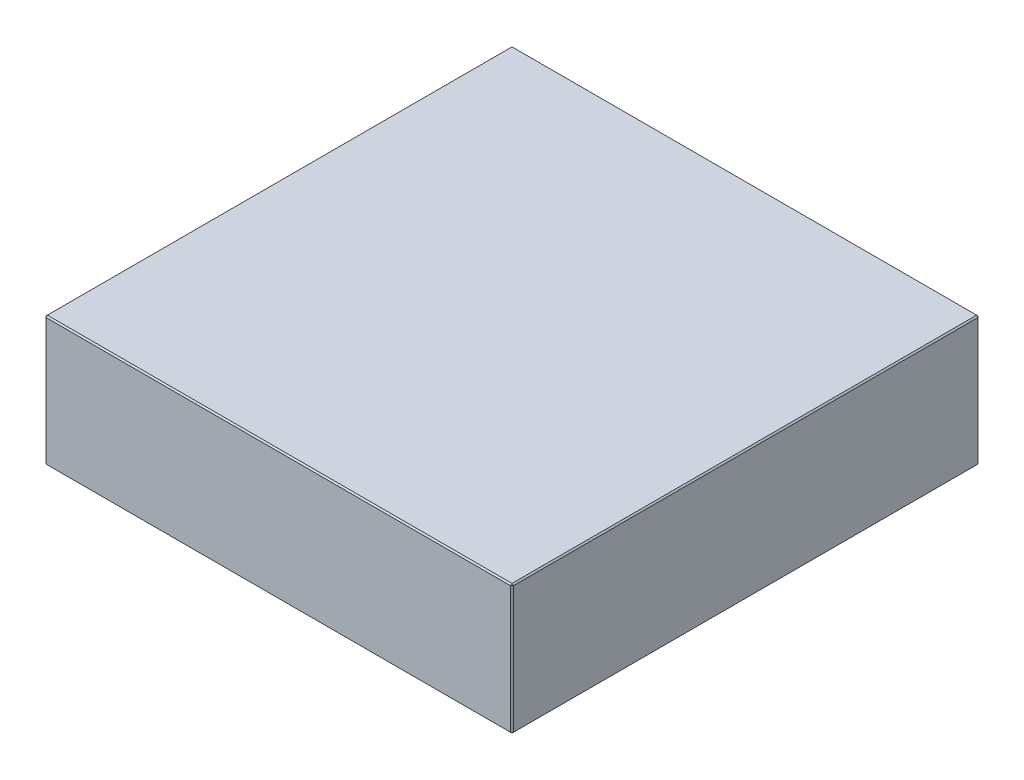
ISO-10303-21;
HEADER;
FILE_DESCRIPTION(('STEP AP214'),'2;1');
FILE_NAME('part.step','',(''),(''),'','','');
FILE_SCHEMA(('AUTOMOTIVE_DESIGN { 1 0 10303 214 1 1 1 1 }'));
ENDSEC;
DATA;
#1=APPLICATION_CONTEXT('core data for automotive mechanical design processes');
#2=APPLICATION_PROTOCOL_DEFINITION('international standard','automotive_design',2000,#1);
#3=PRODUCT_CONTEXT('',#1,'mechanical');
#4=PRODUCT('Part','Part','',(#3));
#5=PRODUCT_RELATED_PRODUCT_CATEGORY('part','',(#4));
#6=PRODUCT_DEFINITION_FORMATION('','',#4);
#7=PRODUCT_DEFINITION_CONTEXT('part definition',#1,'design');
#8=PRODUCT_DEFINITION('design','',#6,#7);
#9=PRODUCT_DEFINITION_SHAPE('','',#8);
#10=(LENGTH_UNIT() NAMED_UNIT(*) SI_UNIT(.MILLI.,.METRE.));
#11=(NAMED_UNIT(*) PLANE_ANGLE_UNIT() SI_UNIT($,.RADIAN.));
#12=(NAMED_UNIT(*) SI_UNIT($,.STERADIAN.) SOLID_ANGLE_UNIT());
#13=UNCERTAINTY_MEASURE_WITH_UNIT(LENGTH_MEASURE(1.E-05),#10,'distance_accuracy_value','');
#14=(GEOMETRIC_REPRESENTATION_CONTEXT(3) GLOBAL_UNCERTAINTY_ASSIGNED_CONTEXT((#13)) GLOBAL_UNIT_ASSIGNED_CONTEXT((#10,
#11,#12)) REPRESENTATION_CONTEXT('',''));
#15=CARTESIAN_POINT('',(0.,0.,0.));
#16=DIRECTION('',(0.,0.,1.));
#17=DIRECTION('',(1.,0.,0.));
#18=AXIS2_PLACEMENT_3D('',#15,#16,#17);
#19=CARTESIAN_POINT('',(-173.,96.,173.));
#20=DIRECTION('',(1.,0.,0.));
#21=DIRECTION('',(0.,0.,-1.));
#22=AXIS2_PLACEMENT_3D('',#19,#20,#21);
#23=PLANE('',#22);
#24=DIRECTION('',(0.,-1.,0.));
#25=VECTOR('',#24,1.);
#26=CARTESIAN_POINT('',(-173.,96.,-172.));
#27=LINE('',#26,#25);
#28=CARTESIAN_POINT('',(-173.,95.,-172.));
#29=VERTEX_POINT('',#28);
#30=CARTESIAN_POINT('',(-173.,0.999999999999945,-172.));
#31=VERTEX_POINT('',#30);
#32=EDGE_CURVE('E114',#29,#31,#27,.T.);
#33=ORIENTED_EDGE('',*,*,#32,.T.);
#34=DIRECTION('',(0.,0.,1.));
#35=VECTOR('',#34,1.);
#36=CARTESIAN_POINT('',(-173.,0.999999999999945,173.));
#37=LINE('',#36,#35);
#38=CARTESIAN_POINT('',(-173.,0.999999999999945,172.));
#39=VERTEX_POINT('',#38);
#40=EDGE_CURVE('E110',#31,#39,#37,.T.);
#41=ORIENTED_EDGE('',*,*,#40,.T.);
#42=DIRECTION('',(0.,1.,0.));
#43=VECTOR('',#42,1.);
#44=CARTESIAN_POINT('',(-173.,96.,172.));
#45=LINE('',#44,#43);
#46=CARTESIAN_POINT('',(-173.,95.,172.));
#47=VERTEX_POINT('',#46);
#48=EDGE_CURVE('E103',#39,#47,#45,.T.);
#49=ORIENTED_EDGE('',*,*,#48,.T.);
#50=DIRECTION('',(0.,0.,-1.));
#51=VECTOR('',#50,1.);
#52=CARTESIAN_POINT('',(-173.,95.,-173.));
#53=LINE('',#52,#51);
#54=EDGE_CURVE('E107',#47,#29,#53,.T.);
#55=ORIENTED_EDGE('',*,*,#54,.T.);
#56=EDGE_LOOP('',(#33,#41,#49,#55));
#57=FACE_BOUND('',#56,.T.);
#58=ADVANCED_FACE('F15',(#57),#23,.F.);
#59=CARTESIAN_POINT('',(173.,96.,173.));
#60=DIRECTION('',(0.,0.,-1.));
#61=DIRECTION('',(-1.,0.,0.));
#62=AXIS2_PLACEMENT_3D('',#59,#60,#61);
#63=PLANE('',#62);
#64=DIRECTION('',(-1.,0.,0.));
#65=VECTOR('',#64,1.);
#66=CARTESIAN_POINT('',(-173.,95.,173.));
#67=LINE('',#66,#65);
#68=CARTESIAN_POINT('',(172.,95.,173.));
#69=VERTEX_POINT('',#68);
#70=CARTESIAN_POINT('',(-172.,95.,173.));
#71=VERTEX_POINT('',#70);
#72=EDGE_CURVE('E164',#69,#71,#67,.T.);
#73=ORIENTED_EDGE('',*,*,#72,.T.);
#74=DIRECTION('',(0.,-1.,0.));
#75=VECTOR('',#74,1.);
#76=CARTESIAN_POINT('',(-172.,96.,173.));
#77=LINE('',#76,#75);
#78=CARTESIAN_POINT('',(-172.,0.999999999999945,173.));
#79=VERTEX_POINT('',#78);
#80=EDGE_CURVE('E122',#71,#79,#77,.T.);
#81=ORIENTED_EDGE('',*,*,#80,.T.);
#82=DIRECTION('',(1.,0.,0.));
#83=VECTOR('',#82,1.);
#84=CARTESIAN_POINT('',(173.,0.999999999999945,173.));
#85=LINE('',#84,#83);
#86=CARTESIAN_POINT('',(172.,0.999999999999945,173.));
#87=VERTEX_POINT('',#86);
#88=EDGE_CURVE('E168',#79,#87,#85,.T.);
#89=ORIENTED_EDGE('',*,*,#88,.T.);
#90=DIRECTION('',(0.,1.,0.));
#91=VECTOR('',#90,1.);
#92=CARTESIAN_POINT('',(172.,96.,173.));
#93=LINE('',#92,#91);
#94=EDGE_CURVE('E166',#87,#69,#93,.T.);
#95=ORIENTED_EDGE('',*,*,#94,.T.);
#96=EDGE_LOOP('',(#73,#81,#89,#95));
#97=FACE_BOUND('',#96,.T.);
#98=ADVANCED_FACE('F275',(#97),#63,.F.);
#99=CARTESIAN_POINT('',(173.,96.,173.));
#100=DIRECTION('',(-1.,0.,0.));
#101=DIRECTION('',(0.,0.,1.));
#102=AXIS2_PLACEMENT_3D('',#99,#100,#101);
#103=PLANE('',#102);
#104=DIRECTION('',(0.,0.,-1.));
#105=VECTOR('',#104,1.);
#106=CARTESIAN_POINT('',(173.,0.999999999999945,173.));
#107=LINE('',#106,#105);
#108=CARTESIAN_POINT('',(173.,0.999999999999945,172.));
#109=VERTEX_POINT('',#108);
#110=CARTESIAN_POINT('',(173.,0.999999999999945,-172.));
#111=VERTEX_POINT('',#110);
#112=EDGE_CURVE('E159',#109,#111,#107,.T.);
#113=ORIENTED_EDGE('',*,*,#112,.T.);
#114=DIRECTION('',(0.,1.,0.));
#115=VECTOR('',#114,1.);
#116=CARTESIAN_POINT('',(173.,96.,-172.));
#117=LINE('',#116,#115);
#118=CARTESIAN_POINT('',(173.,95.,-172.));
#119=VERTEX_POINT('',#118);
#120=EDGE_CURVE('E161',#111,#119,#117,.T.);
#121=ORIENTED_EDGE('',*,*,#120,.T.);
#122=DIRECTION('',(0.,0.,1.));
#123=VECTOR('',#122,1.);
#124=CARTESIAN_POINT('',(173.,95.,173.));
#125=LINE('',#124,#123);
#126=CARTESIAN_POINT('',(173.,95.,172.));
#127=VERTEX_POINT('',#126);
#128=EDGE_CURVE('E155',#119,#127,#125,.T.);
#129=ORIENTED_EDGE('',*,*,#128,.T.);
#130=DIRECTION('',(0.,-1.,0.));
#131=VECTOR('',#130,1.);
#132=CARTESIAN_POINT('',(173.,96.,172.));
#133=LINE('',#132,#131);
#134=EDGE_CURVE('E157',#127,#109,#133,.T.);
#135=ORIENTED_EDGE('',*,*,#134,.T.);
#136=EDGE_LOOP('',(#113,#121,#129,#135));
#137=FACE_BOUND('',#136,.T.);
#138=ADVANCED_FACE('F254',(#137),#103,.F.);
#139=CARTESIAN_POINT('',(173.,96.,-173.));
#140=DIRECTION('',(0.,0.,1.));
#141=DIRECTION('',(1.,0.,0.));
#142=AXIS2_PLACEMENT_3D('',#139,#140,#141);
#143=PLANE('',#142);
#144=DIRECTION('',(0.,-1.,0.));
#145=VECTOR('',#144,1.);
#146=CARTESIAN_POINT('',(172.,96.,-173.));
#147=LINE('',#146,#145);
#148=CARTESIAN_POINT('',(172.,95.,-173.));
#149=VERTEX_POINT('',#148);
#150=CARTESIAN_POINT('',(172.,0.999999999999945,-173.));
#151=VERTEX_POINT('',#150);
#152=EDGE_CURVE('E148',#149,#151,#147,.T.);
#153=ORIENTED_EDGE('',*,*,#152,.T.);
#154=DIRECTION('',(-1.,0.,0.));
#155=VECTOR('',#154,1.);
#156=CARTESIAN_POINT('',(173.,0.999999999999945,-173.));
#157=LINE('',#156,#155);
#158=CARTESIAN_POINT('',(-172.,0.999999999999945,-173.));
#159=VERTEX_POINT('',#158);
#160=EDGE_CURVE('E153',#151,#159,#157,.T.);
#161=ORIENTED_EDGE('',*,*,#160,.T.);
#162=DIRECTION('',(0.,1.,0.));
#163=VECTOR('',#162,1.);
#164=CARTESIAN_POINT('',(-172.,96.,-173.));
#165=LINE('',#164,#163);
#166=CARTESIAN_POINT('',(-172.,95.,-173.));
#167=VERTEX_POINT('',#166);
#168=EDGE_CURVE('E150',#159,#167,#165,.T.);
#169=ORIENTED_EDGE('',*,*,#168,.T.);
#170=DIRECTION('',(1.,0.,0.));
#171=VECTOR('',#170,1.);
#172=CARTESIAN_POINT('',(173.,95.,-173.));
#173=LINE('',#172,#171);
#174=EDGE_CURVE('E146',#167,#149,#173,.T.);
#175=ORIENTED_EDGE('',*,*,#174,.T.);
#176=EDGE_LOOP('',(#153,#161,#169,#175));
#177=FACE_BOUND('',#176,.T.);
#178=ADVANCED_FACE('F284',(#177),#143,.F.);
#179=CARTESIAN_POINT('',(0.,96.,0.));
#180=DIRECTION('',(0.,1.,0.));
#181=DIRECTION('',(0.,0.,1.));
#182=AXIS2_PLACEMENT_3D('',#179,#180,#181);
#183=PLANE('',#182);
#184=DIRECTION('',(0.,0.,-1.));
#185=VECTOR('',#184,1.);
#186=CARTESIAN_POINT('',(172.,96.,-173.));
#187=LINE('',#186,#185);
#188=CARTESIAN_POINT('',(172.,96.,172.));
#189=VERTEX_POINT('',#188);
#190=CARTESIAN_POINT('',(172.,96.,-172.));
#191=VERTEX_POINT('',#190);
#192=EDGE_CURVE('E24',#189,#191,#187,.T.);
#193=ORIENTED_EDGE('',*,*,#192,.T.);
#194=DIRECTION('',(-1.,0.,0.));
#195=VECTOR('',#194,1.);
#196=CARTESIAN_POINT('',(-173.,96.,-172.));
#197=LINE('',#196,#195);
#198=CARTESIAN_POINT('',(-172.,96.,-172.));
#199=VERTEX_POINT('',#198);
#200=EDGE_CURVE('E9',#191,#199,#197,.T.);
#201=ORIENTED_EDGE('',*,*,#200,.T.);
#202=DIRECTION('',(0.,0.,1.));
#203=VECTOR('',#202,1.);
#204=CARTESIAN_POINT('',(-172.,96.,173.));
#205=LINE('',#204,#203);
#206=CARTESIAN_POINT('',(-172.,96.,172.));
#207=VERTEX_POINT('',#206);
#208=EDGE_CURVE('E180',#199,#207,#205,.T.);
#209=ORIENTED_EDGE('',*,*,#208,.T.);
#210=DIRECTION('',(1.,0.,0.));
#211=VECTOR('',#210,1.);
#212=CARTESIAN_POINT('',(173.,96.,172.));
#213=LINE('',#212,#211);
#214=EDGE_CURVE('E35',#207,#189,#213,.T.);
#215=ORIENTED_EDGE('',*,*,#214,.T.);
#216=EDGE_LOOP('',(#193,#201,#209,#215));
#217=FACE_BOUND('',#216,.T.);
#218=ADVANCED_FACE('F350',(#217),#183,.T.);
#219=CARTESIAN_POINT('',(0.,0.,0.));
#220=DIRECTION('',(0.,1.,0.));
#221=DIRECTION('',(0.,0.,1.));
#222=AXIS2_PLACEMENT_3D('',#219,#220,#221);
#223=PLANE('',#222);
#224=DIRECTION('',(0.,0.,1.));
#225=VECTOR('',#224,1.);
#226=CARTESIAN_POINT('',(172.,0.,0.));
#227=LINE('',#226,#225);
#228=CARTESIAN_POINT('',(172.,0.,-172.));
#229=VERTEX_POINT('',#228);
#230=CARTESIAN_POINT('',(172.,0.,172.));
#231=VERTEX_POINT('',#230);
#232=EDGE_CURVE('E171',#229,#231,#227,.T.);
#233=ORIENTED_EDGE('',*,*,#232,.T.);
#234=DIRECTION('',(-1.,0.,0.));
#235=VECTOR('',#234,1.);
#236=CARTESIAN_POINT('',(0.,0.,172.));
#237=LINE('',#236,#235);
#238=CARTESIAN_POINT('',(-172.,0.,172.));
#239=VERTEX_POINT('',#238);
#240=EDGE_CURVE('E177',#231,#239,#237,.T.);
#241=ORIENTED_EDGE('',*,*,#240,.T.);
#242=DIRECTION('',(0.,0.,-1.));
#243=VECTOR('',#242,1.);
#244=CARTESIAN_POINT('',(-172.,0.,0.));
#245=LINE('',#244,#243);
#246=CARTESIAN_POINT('',(-172.,0.,-172.));
#247=VERTEX_POINT('',#246);
#248=EDGE_CURVE('E175',#239,#247,#245,.T.);
#249=ORIENTED_EDGE('',*,*,#248,.T.);
#250=DIRECTION('',(1.,0.,0.));
#251=VECTOR('',#250,1.);
#252=CARTESIAN_POINT('',(0.,0.,-172.));
#253=LINE('',#252,#251);
#254=EDGE_CURVE('E173',#247,#229,#253,.T.);
#255=ORIENTED_EDGE('',*,*,#254,.T.);
#256=EDGE_LOOP('',(#233,#241,#249,#255));
#257=FACE_BOUND('',#256,.T.);
#258=ADVANCED_FACE('F246',(#257),#223,.F.);
#259=CARTESIAN_POINT('',(173.,96.,172.));
#260=DIRECTION('',(-0.707106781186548,0.,-0.707106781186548));
#261=DIRECTION('',(0.,-1.,0.));
#262=AXIS2_PLACEMENT_3D('',#259,#260,#261);
#263=PLANE('',#262);
#264=DIRECTION('',(-0.707106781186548,0.,0.707106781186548));
#265=VECTOR('',#264,1.);
#266=CARTESIAN_POINT('',(172.,95.,173.));
#267=LINE('',#266,#265);
#268=EDGE_CURVE('E19',#69,#127,#267,.F.);
#269=ORIENTED_EDGE('',*,*,#268,.F.);
#270=ORIENTED_EDGE('',*,*,#94,.F.);
#271=DIRECTION('',(0.707106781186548,0.,-0.707106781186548));
#272=VECTOR('',#271,1.);
#273=CARTESIAN_POINT('',(172.,0.999999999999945,173.));
#274=LINE('',#273,#272);
#275=EDGE_CURVE('E142',#109,#87,#274,.F.);
#276=ORIENTED_EDGE('',*,*,#275,.F.);
#277=ORIENTED_EDGE('',*,*,#134,.F.);
#278=EDGE_LOOP('',(#269,#270,#276,#277));
#279=FACE_BOUND('',#278,.T.);
#280=ADVANCED_FACE('F17',(#279),#263,.F.);
#281=CARTESIAN_POINT('',(172.,95.,173.));
#282=DIRECTION('',(0.577350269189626,0.577350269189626,0.577350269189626));
#283=DIRECTION('',(0.707106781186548,0.,-0.707106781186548));
#284=AXIS2_PLACEMENT_3D('',#281,#282,#283);
#285=PLANE('',#284);
#286=DIRECTION('',(0.,-0.707106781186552,0.707106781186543));
#287=VECTOR('',#286,1.);
#288=CARTESIAN_POINT('',(172.,95.,173.));
#289=LINE('',#288,#287);
#290=EDGE_CURVE('E226',#69,#189,#289,.F.);
#291=ORIENTED_EDGE('',*,*,#290,.F.);
#292=ORIENTED_EDGE('',*,*,#268,.T.);
#293=DIRECTION('',(-0.707106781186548,0.707106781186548,0.));
#294=VECTOR('',#293,1.);
#295=CARTESIAN_POINT('',(172.5,95.5,172.));
#296=LINE('',#295,#294);
#297=EDGE_CURVE('E228',#189,#127,#296,.F.);
#298=ORIENTED_EDGE('',*,*,#297,.F.);
#299=EDGE_LOOP('',(#291,#292,#298));
#300=FACE_BOUND('',#299,.T.);
#301=ADVANCED_FACE('F270',(#300),#285,.T.);
#302=CARTESIAN_POINT('',(172.,0.999999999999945,173.));
#303=DIRECTION('',(0.577350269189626,-0.577350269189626,0.577350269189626));
#304=DIRECTION('',(0.707106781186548,0.,-0.707106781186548));
#305=AXIS2_PLACEMENT_3D('',#302,#303,#304);
#306=PLANE('',#305);
#307=DIRECTION('',(-0.707106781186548,-0.707106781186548,0.));
#308=VECTOR('',#307,1.);
#309=CARTESIAN_POINT('',(172.5,0.499999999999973,172.));
#310=LINE('',#309,#308);
#311=EDGE_CURVE('E220',#109,#231,#310,.T.);
#312=ORIENTED_EDGE('',*,*,#311,.F.);
#313=ORIENTED_EDGE('',*,*,#275,.T.);
#314=DIRECTION('',(0.,0.707106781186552,0.707106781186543));
#315=VECTOR('',#314,1.);
#316=CARTESIAN_POINT('',(172.,0.999999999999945,173.));
#317=LINE('',#316,#315);
#318=EDGE_CURVE('E223',#231,#87,#317,.T.);
#319=ORIENTED_EDGE('',*,*,#318,.F.);
#320=EDGE_LOOP('',(#312,#313,#319));
#321=FACE_BOUND('',#320,.T.);
#322=ADVANCED_FACE('F235',(#321),#306,.T.);
#323=CARTESIAN_POINT('',(172.,96.,0.));
#324=DIRECTION('',(0.707106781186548,0.707106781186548,0.));
#325=DIRECTION('',(0.,0.,1.));
#326=AXIS2_PLACEMENT_3D('',#323,#324,#325);
#327=PLANE('',#326);
#328=ORIENTED_EDGE('',*,*,#297,.T.);
#329=ORIENTED_EDGE('',*,*,#128,.F.);
#330=DIRECTION('',(0.707106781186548,-0.707106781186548,0.));
#331=VECTOR('',#330,1.);
#332=CARTESIAN_POINT('',(173.,95.,-172.));
#333=LINE('',#332,#331);
#334=EDGE_CURVE('E215',#191,#119,#333,.T.);
#335=ORIENTED_EDGE('',*,*,#334,.F.);
#336=ORIENTED_EDGE('',*,*,#192,.F.);
#337=EDGE_LOOP('',(#328,#329,#335,#336));
#338=FACE_BOUND('',#337,.T.);
#339=ADVANCED_FACE('F265',(#338),#327,.T.);
#340=CARTESIAN_POINT('',(0.,96.,172.));
#341=DIRECTION('',(0.,0.707106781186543,0.707106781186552));
#342=DIRECTION('',(-1.,0.,0.));
#343=AXIS2_PLACEMENT_3D('',#340,#341,#342);
#344=PLANE('',#343);
#345=ORIENTED_EDGE('',*,*,#290,.T.);
#346=ORIENTED_EDGE('',*,*,#214,.F.);
#347=DIRECTION('',(0.,0.707106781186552,-0.707106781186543));
#348=VECTOR('',#347,1.);
#349=CARTESIAN_POINT('',(-172.,95.5,172.5));
#350=LINE('',#349,#348);
#351=EDGE_CURVE('E126',#71,#207,#350,.T.);
#352=ORIENTED_EDGE('',*,*,#351,.F.);
#353=ORIENTED_EDGE('',*,*,#72,.F.);
#354=EDGE_LOOP('',(#345,#346,#352,#353));
#355=FACE_BOUND('',#354,.T.);
#356=ADVANCED_FACE('F273',(#355),#344,.T.);
#357=CARTESIAN_POINT('',(-172.,96.,173.));
#358=DIRECTION('',(0.707106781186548,0.,-0.707106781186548));
#359=DIRECTION('',(0.,-1.,0.));
#360=AXIS2_PLACEMENT_3D('',#357,#358,#359);
#361=PLANE('',#360);
#362=DIRECTION('',(0.707106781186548,0.,0.707106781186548));
#363=VECTOR('',#362,1.);
#364=CARTESIAN_POINT('',(-172.,0.999999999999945,173.));
#365=LINE('',#364,#363);
#366=EDGE_CURVE('E127',#79,#39,#365,.F.);
#367=ORIENTED_EDGE('',*,*,#366,.F.);
#368=ORIENTED_EDGE('',*,*,#80,.F.);
#369=DIRECTION('',(-0.707106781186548,0.,-0.707106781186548));
#370=VECTOR('',#369,1.);
#371=CARTESIAN_POINT('',(-173.,95.,172.));
#372=LINE('',#371,#370);
#373=EDGE_CURVE('E118',#47,#71,#372,.F.);
#374=ORIENTED_EDGE('',*,*,#373,.F.);
#375=ORIENTED_EDGE('',*,*,#48,.F.);
#376=EDGE_LOOP('',(#367,#368,#374,#375));
#377=FACE_BOUND('',#376,.T.);
#378=ADVANCED_FACE('F120',(#377),#361,.F.);
#379=CARTESIAN_POINT('',(173.,0.999999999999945,173.));
#380=DIRECTION('',(0.,0.707106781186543,-0.707106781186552));
#381=DIRECTION('',(1.,0.,0.));
#382=AXIS2_PLACEMENT_3D('',#379,#380,#381);
#383=PLANE('',#382);
#384=ORIENTED_EDGE('',*,*,#318,.T.);
#385=ORIENTED_EDGE('',*,*,#88,.F.);
#386=DIRECTION('',(0.,-0.707106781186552,-0.707106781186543));
#387=VECTOR('',#386,1.);
#388=CARTESIAN_POINT('',(-172.,0.999999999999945,173.));
#389=LINE('',#388,#387);
#390=EDGE_CURVE('E211',#239,#79,#389,.F.);
#391=ORIENTED_EDGE('',*,*,#390,.F.);
#392=ORIENTED_EDGE('',*,*,#240,.F.);
#393=EDGE_LOOP('',(#384,#385,#391,#392));
#394=FACE_BOUND('',#393,.T.);
#395=ADVANCED_FACE('F243',(#394),#383,.F.);
#396=CARTESIAN_POINT('',(173.,0.999999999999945,173.));
#397=DIRECTION('',(-0.707106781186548,0.707106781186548,0.));
#398=DIRECTION('',(0.,0.,-1.));
#399=AXIS2_PLACEMENT_3D('',#396,#397,#398);
#400=PLANE('',#399);
#401=ORIENTED_EDGE('',*,*,#311,.T.);
#402=ORIENTED_EDGE('',*,*,#232,.F.);
#403=DIRECTION('',(0.707106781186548,0.707106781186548,0.));
#404=VECTOR('',#403,1.);
#405=CARTESIAN_POINT('',(172.5,0.499999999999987,-172.));
#406=LINE('',#405,#404);
#407=EDGE_CURVE('E208',#111,#229,#406,.F.);
#408=ORIENTED_EDGE('',*,*,#407,.F.);
#409=ORIENTED_EDGE('',*,*,#112,.F.);
#410=EDGE_LOOP('',(#401,#402,#408,#409));
#411=FACE_BOUND('',#410,.T.);
#412=ADVANCED_FACE('F251',(#411),#400,.F.);
#413=CARTESIAN_POINT('',(172.,96.,-173.));
#414=DIRECTION('',(-0.707106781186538,0.,0.707106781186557));
#415=DIRECTION('',(0.,-1.,0.));
#416=AXIS2_PLACEMENT_3D('',#413,#414,#415);
#417=PLANE('',#416);
#418=DIRECTION('',(0.707106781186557,0.,0.707106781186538));
#419=VECTOR('',#418,1.);
#420=CARTESIAN_POINT('',(173.,95.,-172.));
#421=LINE('',#420,#419);
#422=EDGE_CURVE('E217',#119,#149,#421,.F.);
#423=ORIENTED_EDGE('',*,*,#422,.F.);
#424=ORIENTED_EDGE('',*,*,#120,.F.);
#425=DIRECTION('',(-0.707106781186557,0.,-0.707106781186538));
#426=VECTOR('',#425,1.);
#427=CARTESIAN_POINT('',(172.,0.999999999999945,-173.));
#428=LINE('',#427,#426);
#429=EDGE_CURVE('E205',#151,#111,#428,.F.);
#430=ORIENTED_EDGE('',*,*,#429,.F.);
#431=ORIENTED_EDGE('',*,*,#152,.F.);
#432=EDGE_LOOP('',(#423,#424,#430,#431));
#433=FACE_BOUND('',#432,.T.);
#434=ADVANCED_FACE('F258',(#433),#417,.F.);
#435=CARTESIAN_POINT('',(173.,95.,-172.));
#436=DIRECTION('',(0.577350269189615,0.577350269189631,-0.577350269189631));
#437=DIRECTION('',(0.,0.707106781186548,0.707106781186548));
#438=AXIS2_PLACEMENT_3D('',#435,#436,#437);
#439=PLANE('',#438);
#440=ORIENTED_EDGE('',*,*,#334,.T.);
#441=ORIENTED_EDGE('',*,*,#422,.T.);
#442=DIRECTION('',(0.,0.707106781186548,0.707106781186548));
#443=VECTOR('',#442,1.);
#444=CARTESIAN_POINT('',(172.,95.5,-172.5));
#445=LINE('',#444,#443);
#446=EDGE_CURVE('E134',#191,#149,#445,.F.);
#447=ORIENTED_EDGE('',*,*,#446,.F.);
#448=EDGE_LOOP('',(#440,#441,#447));
#449=FACE_BOUND('',#448,.T.);
#450=ADVANCED_FACE('F325',(#449),#439,.T.);
#451=CARTESIAN_POINT('',(-173.,95.,172.));
#452=DIRECTION('',(-0.577350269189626,0.577350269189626,0.577350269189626));
#453=DIRECTION('',(0.707106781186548,0.,0.707106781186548));
#454=AXIS2_PLACEMENT_3D('',#451,#452,#453);
#455=PLANE('',#454);
#456=ORIENTED_EDGE('',*,*,#373,.T.);
#457=ORIENTED_EDGE('',*,*,#351,.T.);
#458=DIRECTION('',(-0.707106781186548,-0.707106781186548,0.));
#459=VECTOR('',#458,1.);
#460=CARTESIAN_POINT('',(-173.,95.,172.));
#461=LINE('',#460,#459);
#462=EDGE_CURVE('E130',#47,#207,#461,.F.);
#463=ORIENTED_EDGE('',*,*,#462,.F.);
#464=EDGE_LOOP('',(#456,#457,#463));
#465=FACE_BOUND('',#464,.T.);
#466=ADVANCED_FACE('F131',(#465),#455,.T.);
#467=CARTESIAN_POINT('',(-172.,0.999999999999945,173.));
#468=DIRECTION('',(-0.577350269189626,-0.577350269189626,0.577350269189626));
#469=DIRECTION('',(0.707106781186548,0.,0.707106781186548));
#470=AXIS2_PLACEMENT_3D('',#467,#468,#469);
#471=PLANE('',#470);
#472=ORIENTED_EDGE('',*,*,#390,.T.);
#473=ORIENTED_EDGE('',*,*,#366,.T.);
#474=DIRECTION('',(-0.707106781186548,0.707106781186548,0.));
#475=VECTOR('',#474,1.);
#476=CARTESIAN_POINT('',(-172.5,0.499999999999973,172.));
#477=LINE('',#476,#475);
#478=EDGE_CURVE('E135',#239,#39,#477,.T.);
#479=ORIENTED_EDGE('',*,*,#478,.F.);
#480=EDGE_LOOP('',(#472,#473,#479));
#481=FACE_BOUND('',#480,.T.);
#482=ADVANCED_FACE('F318',(#481),#471,.T.);
#483=CARTESIAN_POINT('',(172.,0.999999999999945,-173.));
#484=DIRECTION('',(0.577350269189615,-0.577350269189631,-0.577350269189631));
#485=DIRECTION('',(0.,0.707106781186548,-0.707106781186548));
#486=AXIS2_PLACEMENT_3D('',#483,#484,#485);
#487=PLANE('',#486);
#488=ORIENTED_EDGE('',*,*,#429,.T.);
#489=ORIENTED_EDGE('',*,*,#407,.T.);
#490=DIRECTION('',(0.,-0.707106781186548,0.707106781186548));
#491=VECTOR('',#490,1.);
#492=CARTESIAN_POINT('',(172.,0.999999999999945,-173.));
#493=LINE('',#492,#491);
#494=EDGE_CURVE('E198',#151,#229,#493,.T.);
#495=ORIENTED_EDGE('',*,*,#494,.F.);
#496=EDGE_LOOP('',(#488,#489,#495));
#497=FACE_BOUND('',#496,.T.);
#498=ADVANCED_FACE('F314',(#497),#487,.T.);
#499=CARTESIAN_POINT('',(0.,96.,-172.));
#500=DIRECTION('',(0.,0.707106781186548,-0.707106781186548));
#501=DIRECTION('',(1.,0.,0.));
#502=AXIS2_PLACEMENT_3D('',#499,#500,#501);
#503=PLANE('',#502);
#504=ORIENTED_EDGE('',*,*,#446,.T.);
#505=ORIENTED_EDGE('',*,*,#174,.F.);
#506=DIRECTION('',(0.,-0.707106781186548,-0.707106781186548));
#507=VECTOR('',#506,1.);
#508=CARTESIAN_POINT('',(-172.,95.,-173.));
#509=LINE('',#508,#507);
#510=EDGE_CURVE('E195',#199,#167,#509,.T.);
#511=ORIENTED_EDGE('',*,*,#510,.F.);
#512=ORIENTED_EDGE('',*,*,#200,.F.);
#513=EDGE_LOOP('',(#504,#505,#511,#512));
#514=FACE_BOUND('',#513,.T.);
#515=ADVANCED_FACE('F311',(#514),#503,.T.);
#516=CARTESIAN_POINT('',(-172.,96.,0.));
#517=DIRECTION('',(-0.707106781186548,0.707106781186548,0.));
#518=DIRECTION('',(0.,0.,-1.));
#519=AXIS2_PLACEMENT_3D('',#516,#517,#518);
#520=PLANE('',#519);
#521=ORIENTED_EDGE('',*,*,#462,.T.);
#522=ORIENTED_EDGE('',*,*,#208,.F.);
#523=DIRECTION('',(0.707106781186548,0.707106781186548,0.));
#524=VECTOR('',#523,1.);
#525=CARTESIAN_POINT('',(-172.5,95.5,-172.));
#526=LINE('',#525,#524);
#527=EDGE_CURVE('E138',#29,#199,#526,.T.);
#528=ORIENTED_EDGE('',*,*,#527,.F.);
#529=ORIENTED_EDGE('',*,*,#54,.F.);
#530=EDGE_LOOP('',(#521,#522,#528,#529));
#531=FACE_BOUND('',#530,.T.);
#532=ADVANCED_FACE('F137',(#531),#520,.T.);
#533=CARTESIAN_POINT('',(-173.,0.999999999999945,173.));
#534=DIRECTION('',(0.707106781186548,0.707106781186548,0.));
#535=DIRECTION('',(0.,0.,1.));
#536=AXIS2_PLACEMENT_3D('',#533,#534,#535);
#537=PLANE('',#536);
#538=ORIENTED_EDGE('',*,*,#478,.T.);
#539=ORIENTED_EDGE('',*,*,#40,.F.);
#540=DIRECTION('',(0.707106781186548,-0.707106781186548,0.));
#541=VECTOR('',#540,1.);
#542=CARTESIAN_POINT('',(-173.,0.999999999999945,-172.));
#543=LINE('',#542,#541);
#544=EDGE_CURVE('E191',#247,#31,#543,.F.);
#545=ORIENTED_EDGE('',*,*,#544,.F.);
#546=ORIENTED_EDGE('',*,*,#248,.F.);
#547=EDGE_LOOP('',(#538,#539,#545,#546));
#548=FACE_BOUND('',#547,.T.);
#549=ADVANCED_FACE('F304',(#548),#537,.F.);
#550=CARTESIAN_POINT('',(173.,0.999999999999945,-173.));
#551=DIRECTION('',(0.,0.707106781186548,0.707106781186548));
#552=DIRECTION('',(-1.,0.,0.));
#553=AXIS2_PLACEMENT_3D('',#550,#551,#552);
#554=PLANE('',#553);
#555=ORIENTED_EDGE('',*,*,#494,.T.);
#556=ORIENTED_EDGE('',*,*,#254,.F.);
#557=DIRECTION('',(0.,0.707106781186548,-0.707106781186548));
#558=VECTOR('',#557,1.);
#559=CARTESIAN_POINT('',(-172.,0.499999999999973,-172.5));
#560=LINE('',#559,#558);
#561=EDGE_CURVE('E188',#159,#247,#560,.F.);
#562=ORIENTED_EDGE('',*,*,#561,.F.);
#563=ORIENTED_EDGE('',*,*,#160,.F.);
#564=EDGE_LOOP('',(#555,#556,#562,#563));
#565=FACE_BOUND('',#564,.T.);
#566=ADVANCED_FACE('F300',(#565),#554,.F.);
#567=CARTESIAN_POINT('',(-172.,95.,-173.));
#568=DIRECTION('',(-0.577350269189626,0.577350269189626,-0.577350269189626));
#569=DIRECTION('',(-0.707106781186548,0.,0.707106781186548));
#570=AXIS2_PLACEMENT_3D('',#567,#568,#569);
#571=PLANE('',#570);
#572=ORIENTED_EDGE('',*,*,#527,.T.);
#573=ORIENTED_EDGE('',*,*,#510,.T.);
#574=DIRECTION('',(0.707106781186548,0.,-0.707106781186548));
#575=VECTOR('',#574,1.);
#576=CARTESIAN_POINT('',(-172.,95.,-173.));
#577=LINE('',#576,#575);
#578=EDGE_CURVE('E186',#29,#167,#577,.T.);
#579=ORIENTED_EDGE('',*,*,#578,.F.);
#580=EDGE_LOOP('',(#572,#573,#579));
#581=FACE_BOUND('',#580,.T.);
#582=ADVANCED_FACE('F296',(#581),#571,.T.);
#583=CARTESIAN_POINT('',(-173.,0.999999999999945,-172.));
#584=DIRECTION('',(-0.577350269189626,-0.577350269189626,-0.577350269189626));
#585=DIRECTION('',(-0.707106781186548,0.,0.707106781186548));
#586=AXIS2_PLACEMENT_3D('',#583,#584,#585);
#587=PLANE('',#586);
#588=ORIENTED_EDGE('',*,*,#561,.T.);
#589=ORIENTED_EDGE('',*,*,#544,.T.);
#590=DIRECTION('',(-0.707106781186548,0.,0.707106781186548));
#591=VECTOR('',#590,1.);
#592=CARTESIAN_POINT('',(-173.,0.999999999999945,-172.));
#593=LINE('',#592,#591);
#594=EDGE_CURVE('E184',#159,#31,#593,.T.);
#595=ORIENTED_EDGE('',*,*,#594,.F.);
#596=EDGE_LOOP('',(#588,#589,#595));
#597=FACE_BOUND('',#596,.T.);
#598=ADVANCED_FACE('F292',(#597),#587,.T.);
#599=CARTESIAN_POINT('',(-173.,96.,-172.));
#600=DIRECTION('',(0.707106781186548,0.,0.707106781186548));
#601=DIRECTION('',(0.,-1.,0.));
#602=AXIS2_PLACEMENT_3D('',#599,#600,#601);
#603=PLANE('',#602);
#604=ORIENTED_EDGE('',*,*,#578,.T.);
#605=ORIENTED_EDGE('',*,*,#168,.F.);
#606=ORIENTED_EDGE('',*,*,#594,.T.);
#607=ORIENTED_EDGE('',*,*,#32,.F.);
#608=EDGE_LOOP('',(#604,#605,#606,#607));
#609=FACE_BOUND('',#608,.T.);
#610=ADVANCED_FACE('F289',(#609),#603,.F.);
#611=CLOSED_SHELL('',(#58,#98,#138,#178,#218,#258,#280,#301,#322,#339,#356,#378,#395,#412,#434,
#450,#466,#482,#498,#515,#532,#549,#566,#582,#598,#610));
#612=MANIFOLD_SOLID_BREP('B1',#611);
#613=ADVANCED_BREP_SHAPE_REPRESENTATION('',(#18,#612),#14);
#614=SHAPE_DEFINITION_REPRESENTATION(#9,#613);
ENDSEC;
END-ISO-10303-21;
